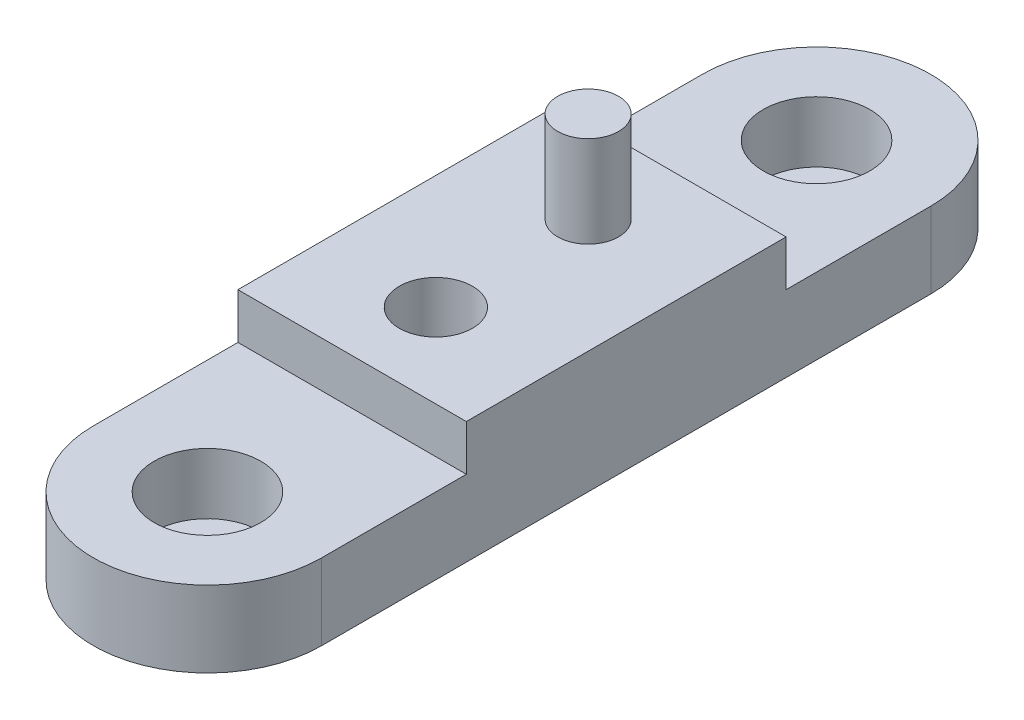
ISO-10303-21;
HEADER;
FILE_DESCRIPTION(('STEP AP214'),'2;1');
FILE_NAME('part.step','',(''),(''),'','','');
FILE_SCHEMA(('AUTOMOTIVE_DESIGN { 1 0 10303 214 1 1 1 1 }'));
ENDSEC;
DATA;
#1=APPLICATION_CONTEXT('core data for automotive mechanical design processes');
#2=APPLICATION_PROTOCOL_DEFINITION('international standard','automotive_design',2000,#1);
#3=PRODUCT_CONTEXT('',#1,'mechanical');
#4=PRODUCT('Part','Part','',(#3));
#5=PRODUCT_RELATED_PRODUCT_CATEGORY('part','',(#4));
#6=PRODUCT_DEFINITION_FORMATION('','',#4);
#7=PRODUCT_DEFINITION_CONTEXT('part definition',#1,'design');
#8=PRODUCT_DEFINITION('design','',#6,#7);
#9=PRODUCT_DEFINITION_SHAPE('','',#8);
#10=(LENGTH_UNIT() NAMED_UNIT(*) SI_UNIT(.MILLI.,.METRE.));
#11=(NAMED_UNIT(*) PLANE_ANGLE_UNIT() SI_UNIT($,.RADIAN.));
#12=(NAMED_UNIT(*) SI_UNIT($,.STERADIAN.) SOLID_ANGLE_UNIT());
#13=UNCERTAINTY_MEASURE_WITH_UNIT(LENGTH_MEASURE(1.E-05),#10,'distance_accuracy_value','');
#14=(GEOMETRIC_REPRESENTATION_CONTEXT(3) GLOBAL_UNCERTAINTY_ASSIGNED_CONTEXT((#13)) GLOBAL_UNIT_ASSIGNED_CONTEXT((#10,
#11,#12)) REPRESENTATION_CONTEXT('',''));
#15=CARTESIAN_POINT('',(0.,0.,0.));
#16=DIRECTION('',(0.,0.,1.));
#17=DIRECTION('',(1.,0.,0.));
#18=AXIS2_PLACEMENT_3D('',#15,#16,#17);
#19=CARTESIAN_POINT('',(0.,4.,0.));
#20=DIRECTION('',(0.,-1.,0.));
#21=DIRECTION('',(0.,0.,-1.));
#22=AXIS2_PLACEMENT_3D('',#19,#20,#21);
#23=CYLINDRICAL_SURFACE('',#22,3.75);
#24=CARTESIAN_POINT('',(0.,2.5,0.));
#25=DIRECTION('',(0.,1.,0.));
#26=DIRECTION('',(0.,0.,1.));
#27=AXIS2_PLACEMENT_3D('',#24,#25,#26);
#28=CIRCLE('',#27,3.75);
#29=CARTESIAN_POINT('',(3.75,2.5,0.));
#30=VERTEX_POINT('',#29);
#31=CARTESIAN_POINT('',(-3.75,2.5,0.));
#32=VERTEX_POINT('',#31);
#33=EDGE_CURVE('E159',#30,#32,#28,.T.);
#34=ORIENTED_EDGE('',*,*,#33,.F.);
#35=DIRECTION('',(0.,-1.,0.));
#36=VECTOR('',#35,1.);
#37=CARTESIAN_POINT('',(3.75,4.,0.));
#38=LINE('',#37,#36);
#39=CARTESIAN_POINT('',(3.75,0.,0.));
#40=VERTEX_POINT('',#39);
#41=EDGE_CURVE('E44',#30,#40,#38,.T.);
#42=ORIENTED_EDGE('',*,*,#41,.T.);
#43=CARTESIAN_POINT('',(0.,0.,0.));
#44=DIRECTION('',(0.,1.,0.));
#45=DIRECTION('',(0.,0.,1.));
#46=AXIS2_PLACEMENT_3D('',#43,#44,#45);
#47=CIRCLE('',#46,3.75);
#48=CARTESIAN_POINT('',(-3.75,0.,0.));
#49=VERTEX_POINT('',#48);
#50=EDGE_CURVE('E165',#40,#49,#47,.T.);
#51=ORIENTED_EDGE('',*,*,#50,.T.);
#52=DIRECTION('',(0.,-1.,0.));
#53=VECTOR('',#52,1.);
#54=CARTESIAN_POINT('',(-3.75,4.,0.));
#55=LINE('',#54,#53);
#56=EDGE_CURVE('E11',#32,#49,#55,.T.);
#57=ORIENTED_EDGE('',*,*,#56,.F.);
#58=EDGE_LOOP('',(#34,#42,#51,#57));
#59=FACE_BOUND('',#58,.T.);
#60=ADVANCED_FACE('F37',(#59),#23,.T.);
#61=CARTESIAN_POINT('',(-3.75,4.,0.));
#62=DIRECTION('',(1.,0.,0.));
#63=DIRECTION('',(0.,0.,-1.));
#64=AXIS2_PLACEMENT_3D('',#61,#62,#63);
#65=PLANE('',#64);
#66=DIRECTION('',(0.,0.,1.));
#67=VECTOR('',#66,1.);
#68=CARTESIAN_POINT('',(-3.75,4.,0.));
#69=LINE('',#68,#67);
#70=CARTESIAN_POINT('',(-3.75,4.,4.75));
#71=VERTEX_POINT('',#70);
#72=CARTESIAN_POINT('',(-3.75,4.,15.25));
#73=VERTEX_POINT('',#72);
#74=EDGE_CURVE('E167',#71,#73,#69,.T.);
#75=ORIENTED_EDGE('',*,*,#74,.F.);
#76=DIRECTION('',(0.,1.,0.));
#77=VECTOR('',#76,1.);
#78=CARTESIAN_POINT('',(-3.75,2.5,4.75));
#79=LINE('',#78,#77);
#80=CARTESIAN_POINT('',(-3.75,2.5,4.75));
#81=VERTEX_POINT('',#80);
#82=EDGE_CURVE('E51',#81,#71,#79,.T.);
#83=ORIENTED_EDGE('',*,*,#82,.F.);
#84=DIRECTION('',(0.,0.,1.));
#85=VECTOR('',#84,1.);
#86=CARTESIAN_POINT('',(-3.75,2.5,0.));
#87=LINE('',#86,#85);
#88=EDGE_CURVE('E151',#32,#81,#87,.T.);
#89=ORIENTED_EDGE('',*,*,#88,.F.);
#90=ORIENTED_EDGE('',*,*,#56,.T.);
#91=DIRECTION('',(0.,0.,1.));
#92=VECTOR('',#91,1.);
#93=CARTESIAN_POINT('',(-3.75,0.,0.));
#94=LINE('',#93,#92);
#95=CARTESIAN_POINT('',(-3.75,0.,20.));
#96=VERTEX_POINT('',#95);
#97=EDGE_CURVE('E174',#49,#96,#94,.T.);
#98=ORIENTED_EDGE('',*,*,#97,.T.);
#99=DIRECTION('',(0.,-1.,0.));
#100=VECTOR('',#99,1.);
#101=CARTESIAN_POINT('',(-3.75,4.,20.));
#102=LINE('',#101,#100);
#103=CARTESIAN_POINT('',(-3.75,2.5,20.));
#104=VERTEX_POINT('',#103);
#105=EDGE_CURVE('E125',#104,#96,#102,.T.);
#106=ORIENTED_EDGE('',*,*,#105,.F.);
#107=DIRECTION('',(0.,0.,-1.));
#108=VECTOR('',#107,1.);
#109=CARTESIAN_POINT('',(-3.75,2.5,20.));
#110=LINE('',#109,#108);
#111=CARTESIAN_POINT('',(-3.75,2.5,15.25));
#112=VERTEX_POINT('',#111);
#113=EDGE_CURVE('E105',#104,#112,#110,.T.);
#114=ORIENTED_EDGE('',*,*,#113,.T.);
#115=DIRECTION('',(0.,1.,0.));
#116=VECTOR('',#115,1.);
#117=CARTESIAN_POINT('',(-3.75,2.5,15.25));
#118=LINE('',#117,#116);
#119=EDGE_CURVE('E114',#112,#73,#118,.T.);
#120=ORIENTED_EDGE('',*,*,#119,.T.);
#121=EDGE_LOOP('',(#75,#83,#89,#90,#98,#106,#114,#120));
#122=FACE_BOUND('',#121,.T.);
#123=ADVANCED_FACE('F123',(#122),#65,.F.);
#124=CARTESIAN_POINT('',(3.75,4.,0.));
#125=DIRECTION('',(-1.,0.,0.));
#126=DIRECTION('',(0.,0.,1.));
#127=AXIS2_PLACEMENT_3D('',#124,#125,#126);
#128=PLANE('',#127);
#129=DIRECTION('',(0.,0.,-1.));
#130=VECTOR('',#129,1.);
#131=CARTESIAN_POINT('',(3.75,2.5,0.));
#132=LINE('',#131,#130);
#133=CARTESIAN_POINT('',(3.75,2.5,4.75));
#134=VERTEX_POINT('',#133);
#135=EDGE_CURVE('E157',#134,#30,#132,.T.);
#136=ORIENTED_EDGE('',*,*,#135,.F.);
#137=DIRECTION('',(0.,1.,0.));
#138=VECTOR('',#137,1.);
#139=CARTESIAN_POINT('',(3.75,2.5,4.75));
#140=LINE('',#139,#138);
#141=CARTESIAN_POINT('',(3.75,4.,4.75));
#142=VERTEX_POINT('',#141);
#143=EDGE_CURVE('E162',#134,#142,#140,.T.);
#144=ORIENTED_EDGE('',*,*,#143,.T.);
#145=DIRECTION('',(0.,0.,-1.));
#146=VECTOR('',#145,1.);
#147=CARTESIAN_POINT('',(3.75,4.,0.));
#148=LINE('',#147,#146);
#149=CARTESIAN_POINT('',(3.75,4.,15.25));
#150=VERTEX_POINT('',#149);
#151=EDGE_CURVE('E169',#150,#142,#148,.T.);
#152=ORIENTED_EDGE('',*,*,#151,.F.);
#153=DIRECTION('',(0.,1.,0.));
#154=VECTOR('',#153,1.);
#155=CARTESIAN_POINT('',(3.75,2.5,15.25));
#156=LINE('',#155,#154);
#157=CARTESIAN_POINT('',(3.75,2.5,15.25));
#158=VERTEX_POINT('',#157);
#159=EDGE_CURVE('E120',#158,#150,#156,.T.);
#160=ORIENTED_EDGE('',*,*,#159,.F.);
#161=DIRECTION('',(0.,0.,1.));
#162=VECTOR('',#161,1.);
#163=CARTESIAN_POINT('',(3.75,2.5,20.));
#164=LINE('',#163,#162);
#165=CARTESIAN_POINT('',(3.75,2.5,20.));
#166=VERTEX_POINT('',#165);
#167=EDGE_CURVE('E107',#158,#166,#164,.T.);
#168=ORIENTED_EDGE('',*,*,#167,.T.);
#169=DIRECTION('',(0.,-1.,0.));
#170=VECTOR('',#169,1.);
#171=CARTESIAN_POINT('',(3.75,4.,20.));
#172=LINE('',#171,#170);
#173=CARTESIAN_POINT('',(3.75,0.,20.));
#174=VERTEX_POINT('',#173);
#175=EDGE_CURVE('E140',#166,#174,#172,.T.);
#176=ORIENTED_EDGE('',*,*,#175,.T.);
#177=DIRECTION('',(0.,0.,-1.));
#178=VECTOR('',#177,1.);
#179=CARTESIAN_POINT('',(3.75,0.,0.));
#180=LINE('',#179,#178);
#181=EDGE_CURVE('E170',#174,#40,#180,.T.);
#182=ORIENTED_EDGE('',*,*,#181,.T.);
#183=ORIENTED_EDGE('',*,*,#41,.F.);
#184=EDGE_LOOP('',(#136,#144,#152,#160,#168,#176,#182,#183));
#185=FACE_BOUND('',#184,.T.);
#186=ADVANCED_FACE('F179',(#185),#128,.F.);
#187=CARTESIAN_POINT('',(0.,4.,0.));
#188=DIRECTION('',(0.,1.,0.));
#189=DIRECTION('',(0.,0.,1.));
#190=AXIS2_PLACEMENT_3D('',#187,#188,#189);
#191=PLANE('',#190);
#192=CARTESIAN_POINT('',(0.,4.,12.5));
#193=DIRECTION('',(0.,1.,0.));
#194=DIRECTION('',(0.,0.,1.));
#195=AXIS2_PLACEMENT_3D('',#192,#193,#194);
#196=CIRCLE('',#195,1.2);
#197=CARTESIAN_POINT('',(0.,4.,13.7));
#198=VERTEX_POINT('',#197);
#199=EDGE_CURVE('E350',#198,#198,#196,.T.);
#200=ORIENTED_EDGE('',*,*,#199,.F.);
#201=EDGE_LOOP('',(#200));
#202=FACE_BOUND('',#201,.T.);
#203=CARTESIAN_POINT('',(0.,4.,7.5));
#204=DIRECTION('',(0.,1.,0.));
#205=DIRECTION('',(0.,0.,1.));
#206=AXIS2_PLACEMENT_3D('',#203,#204,#205);
#207=CIRCLE('',#206,1.);
#208=CARTESIAN_POINT('',(0.,4.,8.5));
#209=VERTEX_POINT('',#208);
#210=EDGE_CURVE('E352',#209,#209,#207,.T.);
#211=ORIENTED_EDGE('',*,*,#210,.F.);
#212=EDGE_LOOP('',(#211));
#213=FACE_BOUND('',#212,.T.);
#214=DIRECTION('',(1.,0.,0.));
#215=VECTOR('',#214,1.);
#216=CARTESIAN_POINT('',(-3.75,4.,4.75));
#217=LINE('',#216,#215);
#218=EDGE_CURVE('E148',#71,#142,#217,.T.);
#219=ORIENTED_EDGE('',*,*,#218,.F.);
#220=ORIENTED_EDGE('',*,*,#74,.T.);
#221=DIRECTION('',(1.,0.,0.));
#222=VECTOR('',#221,1.);
#223=CARTESIAN_POINT('',(-3.75,4.,15.25));
#224=LINE('',#223,#222);
#225=EDGE_CURVE('E117',#73,#150,#224,.T.);
#226=ORIENTED_EDGE('',*,*,#225,.T.);
#227=ORIENTED_EDGE('',*,*,#151,.T.);
#228=EDGE_LOOP('',(#219,#220,#226,#227));
#229=FACE_BOUND('',#228,.T.);
#230=ADVANCED_FACE('F190',(#202,#213,#229),#191,.T.);
#231=CARTESIAN_POINT('',(0.,0.,0.));
#232=DIRECTION('',(0.,1.,0.));
#233=DIRECTION('',(0.,0.,1.));
#234=AXIS2_PLACEMENT_3D('',#231,#232,#233);
#235=PLANE('',#234);
#236=CARTESIAN_POINT('',(0.,0.,12.5));
#237=DIRECTION('',(0.,1.,0.));
#238=DIRECTION('',(0.,0.,1.));
#239=AXIS2_PLACEMENT_3D('',#236,#237,#238);
#240=CIRCLE('',#239,1.2);
#241=CARTESIAN_POINT('',(0.,0.,13.7));
#242=VERTEX_POINT('',#241);
#243=EDGE_CURVE('E347',#242,#242,#240,.T.);
#244=ORIENTED_EDGE('',*,*,#243,.T.);
#245=EDGE_LOOP('',(#244));
#246=FACE_BOUND('',#245,.T.);
#247=ORIENTED_EDGE('',*,*,#50,.F.);
#248=ORIENTED_EDGE('',*,*,#181,.F.);
#249=CARTESIAN_POINT('',(0.,0.,20.));
#250=DIRECTION('',(0.,-1.,0.));
#251=DIRECTION('',(0.,0.,-1.));
#252=AXIS2_PLACEMENT_3D('',#249,#250,#251);
#253=CIRCLE('',#252,3.75);
#254=EDGE_CURVE('E136',#174,#96,#253,.T.);
#255=ORIENTED_EDGE('',*,*,#254,.T.);
#256=ORIENTED_EDGE('',*,*,#97,.F.);
#257=EDGE_LOOP('',(#247,#248,#255,#256));
#258=FACE_BOUND('',#257,.T.);
#259=ADVANCED_FACE('F184',(#246,#258),#235,.F.);
#260=CARTESIAN_POINT('',(-3.75,2.5,4.75));
#261=DIRECTION('',(0.,0.,1.));
#262=DIRECTION('',(1.,0.,0.));
#263=AXIS2_PLACEMENT_3D('',#260,#261,#262);
#264=PLANE('',#263);
#265=ORIENTED_EDGE('',*,*,#218,.T.);
#266=ORIENTED_EDGE('',*,*,#143,.F.);
#267=DIRECTION('',(1.,0.,0.));
#268=VECTOR('',#267,1.);
#269=CARTESIAN_POINT('',(-3.75,2.5,4.75));
#270=LINE('',#269,#268);
#271=EDGE_CURVE('E154',#81,#134,#270,.T.);
#272=ORIENTED_EDGE('',*,*,#271,.F.);
#273=ORIENTED_EDGE('',*,*,#82,.T.);
#274=EDGE_LOOP('',(#265,#266,#272,#273));
#275=FACE_BOUND('',#274,.T.);
#276=ADVANCED_FACE('F215',(#275),#264,.F.);
#277=CARTESIAN_POINT('',(0.,2.5,0.));
#278=DIRECTION('',(0.,1.,0.));
#279=DIRECTION('',(0.,0.,1.));
#280=AXIS2_PLACEMENT_3D('',#277,#278,#279);
#281=PLANE('',#280);
#282=CARTESIAN_POINT('',(0.,2.5,0.));
#283=DIRECTION('',(0.,1.,0.));
#284=DIRECTION('',(0.,0.,1.));
#285=AXIS2_PLACEMENT_3D('',#282,#283,#284);
#286=CIRCLE('',#285,1.75);
#287=CARTESIAN_POINT('',(0.,2.5,1.75));
#288=VERTEX_POINT('',#287);
#289=EDGE_CURVE('E144',#288,#288,#286,.T.);
#290=ORIENTED_EDGE('',*,*,#289,.F.);
#291=EDGE_LOOP('',(#290));
#292=FACE_BOUND('',#291,.T.);
#293=ORIENTED_EDGE('',*,*,#88,.T.);
#294=ORIENTED_EDGE('',*,*,#271,.T.);
#295=ORIENTED_EDGE('',*,*,#135,.T.);
#296=ORIENTED_EDGE('',*,*,#33,.T.);
#297=EDGE_LOOP('',(#293,#294,#295,#296));
#298=FACE_BOUND('',#297,.T.);
#299=ADVANCED_FACE('F188',(#292,#298),#281,.T.);
#300=CARTESIAN_POINT('',(0.,0.5,0.));
#301=DIRECTION('',(0.,1.,0.));
#302=DIRECTION('',(0.,0.,1.));
#303=AXIS2_PLACEMENT_3D('',#300,#301,#302);
#304=CYLINDRICAL_SURFACE('',#303,1.75);
#305=CARTESIAN_POINT('',(0.,0.5,0.));
#306=DIRECTION('',(0.,1.,0.));
#307=DIRECTION('',(0.,0.,1.));
#308=AXIS2_PLACEMENT_3D('',#305,#306,#307);
#309=CIRCLE('',#308,1.75);
#310=CARTESIAN_POINT('',(0.,0.5,1.75));
#311=VERTEX_POINT('',#310);
#312=EDGE_CURVE('E145',#311,#311,#309,.T.);
#313=ORIENTED_EDGE('',*,*,#312,.F.);
#314=EDGE_LOOP('',(#313));
#315=FACE_BOUND('',#314,.T.);
#316=ORIENTED_EDGE('',*,*,#289,.T.);
#317=EDGE_LOOP('',(#316));
#318=FACE_BOUND('',#317,.T.);
#319=ADVANCED_FACE('F201',(#315,#318),#304,.F.);
#320=CARTESIAN_POINT('',(0.,0.5,0.));
#321=DIRECTION('',(0.,1.,0.));
#322=DIRECTION('',(0.,0.,1.));
#323=AXIS2_PLACEMENT_3D('',#320,#321,#322);
#324=PLANE('',#323);
#325=ORIENTED_EDGE('',*,*,#312,.T.);
#326=EDGE_LOOP('',(#325));
#327=FACE_BOUND('',#326,.T.);
#328=ADVANCED_FACE('F194',(#327),#324,.T.);
#329=CARTESIAN_POINT('',(0.,4.,20.));
#330=DIRECTION('',(0.,-1.,0.));
#331=DIRECTION('',(0.,0.,1.));
#332=AXIS2_PLACEMENT_3D('',#329,#330,#331);
#333=CYLINDRICAL_SURFACE('',#332,3.75);
#334=CARTESIAN_POINT('',(0.,2.5,20.));
#335=DIRECTION('',(0.,-1.,0.));
#336=DIRECTION('',(0.,0.,-1.));
#337=AXIS2_PLACEMENT_3D('',#334,#335,#336);
#338=CIRCLE('',#337,3.75);
#339=EDGE_CURVE('E121',#166,#104,#338,.T.);
#340=ORIENTED_EDGE('',*,*,#339,.T.);
#341=ORIENTED_EDGE('',*,*,#105,.T.);
#342=ORIENTED_EDGE('',*,*,#254,.F.);
#343=ORIENTED_EDGE('',*,*,#175,.F.);
#344=EDGE_LOOP('',(#340,#341,#342,#343));
#345=FACE_BOUND('',#344,.T.);
#346=ADVANCED_FACE('F192',(#345),#333,.T.);
#347=CARTESIAN_POINT('',(-3.75,2.5,15.25));
#348=DIRECTION('',(0.,0.,-1.));
#349=DIRECTION('',(1.,0.,0.));
#350=AXIS2_PLACEMENT_3D('',#347,#348,#349);
#351=PLANE('',#350);
#352=ORIENTED_EDGE('',*,*,#225,.F.);
#353=ORIENTED_EDGE('',*,*,#119,.F.);
#354=DIRECTION('',(1.,0.,0.));
#355=VECTOR('',#354,1.);
#356=CARTESIAN_POINT('',(-3.75,2.5,15.25));
#357=LINE('',#356,#355);
#358=EDGE_CURVE('E100',#112,#158,#357,.T.);
#359=ORIENTED_EDGE('',*,*,#358,.T.);
#360=ORIENTED_EDGE('',*,*,#159,.T.);
#361=EDGE_LOOP('',(#352,#353,#359,#360));
#362=FACE_BOUND('',#361,.T.);
#363=ADVANCED_FACE('F115',(#362),#351,.F.);
#364=CARTESIAN_POINT('',(0.,2.5,20.));
#365=DIRECTION('',(0.,1.,0.));
#366=DIRECTION('',(0.,0.,-1.));
#367=AXIS2_PLACEMENT_3D('',#364,#365,#366);
#368=PLANE('',#367);
#369=CARTESIAN_POINT('',(0.,2.5,20.));
#370=DIRECTION('',(0.,-1.,0.));
#371=DIRECTION('',(0.,0.,-1.));
#372=AXIS2_PLACEMENT_3D('',#369,#370,#371);
#373=CIRCLE('',#372,1.75);
#374=CARTESIAN_POINT('',(0.,2.5,18.25));
#375=VERTEX_POINT('',#374);
#376=EDGE_CURVE('E131',#375,#375,#373,.T.);
#377=ORIENTED_EDGE('',*,*,#376,.T.);
#378=EDGE_LOOP('',(#377));
#379=FACE_BOUND('',#378,.T.);
#380=ORIENTED_EDGE('',*,*,#113,.F.);
#381=ORIENTED_EDGE('',*,*,#339,.F.);
#382=ORIENTED_EDGE('',*,*,#167,.F.);
#383=ORIENTED_EDGE('',*,*,#358,.F.);
#384=EDGE_LOOP('',(#380,#381,#382,#383));
#385=FACE_BOUND('',#384,.T.);
#386=ADVANCED_FACE('F102',(#379,#385),#368,.T.);
#387=CARTESIAN_POINT('',(0.,0.5,20.));
#388=DIRECTION('',(0.,1.,0.));
#389=DIRECTION('',(0.,0.,-1.));
#390=AXIS2_PLACEMENT_3D('',#387,#388,#389);
#391=CYLINDRICAL_SURFACE('',#390,1.75);
#392=CARTESIAN_POINT('',(0.,0.5,20.));
#393=DIRECTION('',(0.,-1.,0.));
#394=DIRECTION('',(0.,0.,-1.));
#395=AXIS2_PLACEMENT_3D('',#392,#393,#394);
#396=CIRCLE('',#395,1.75);
#397=CARTESIAN_POINT('',(0.,0.5,18.25));
#398=VERTEX_POINT('',#397);
#399=EDGE_CURVE('E128',#398,#398,#396,.T.);
#400=ORIENTED_EDGE('',*,*,#399,.T.);
#401=EDGE_LOOP('',(#400));
#402=FACE_BOUND('',#401,.T.);
#403=ORIENTED_EDGE('',*,*,#376,.F.);
#404=EDGE_LOOP('',(#403));
#405=FACE_BOUND('',#404,.T.);
#406=ADVANCED_FACE('F292',(#402,#405),#391,.F.);
#407=CARTESIAN_POINT('',(0.,0.5,20.));
#408=DIRECTION('',(0.,1.,0.));
#409=DIRECTION('',(0.,0.,-1.));
#410=AXIS2_PLACEMENT_3D('',#407,#408,#409);
#411=PLANE('',#410);
#412=ORIENTED_EDGE('',*,*,#399,.F.);
#413=EDGE_LOOP('',(#412));
#414=FACE_BOUND('',#413,.T.);
#415=ADVANCED_FACE('F301',(#414),#411,.T.);
#416=CARTESIAN_POINT('',(0.,7.,7.5));
#417=DIRECTION('',(0.,-1.,0.));
#418=DIRECTION('',(0.,0.,-1.));
#419=AXIS2_PLACEMENT_3D('',#416,#417,#418);
#420=CYLINDRICAL_SURFACE('',#419,1.);
#421=CARTESIAN_POINT('',(0.,7.,7.5));
#422=DIRECTION('',(0.,1.,0.));
#423=DIRECTION('',(0.,0.,1.));
#424=AXIS2_PLACEMENT_3D('',#421,#422,#423);
#425=CIRCLE('',#424,1.);
#426=CARTESIAN_POINT('',(0.,7.,8.5));
#427=VERTEX_POINT('',#426);
#428=EDGE_CURVE('E355',#427,#427,#425,.T.);
#429=ORIENTED_EDGE('',*,*,#428,.F.);
#430=EDGE_LOOP('',(#429));
#431=FACE_BOUND('',#430,.T.);
#432=ORIENTED_EDGE('',*,*,#210,.T.);
#433=EDGE_LOOP('',(#432));
#434=FACE_BOUND('',#433,.T.);
#435=ADVANCED_FACE('F310',(#431,#434),#420,.T.);
#436=CARTESIAN_POINT('',(0.,7.,7.5));
#437=DIRECTION('',(0.,1.,0.));
#438=DIRECTION('',(0.,0.,1.));
#439=AXIS2_PLACEMENT_3D('',#436,#437,#438);
#440=PLANE('',#439);
#441=ORIENTED_EDGE('',*,*,#428,.T.);
#442=EDGE_LOOP('',(#441));
#443=FACE_BOUND('',#442,.T.);
#444=ADVANCED_FACE('F319',(#443),#440,.T.);
#445=CARTESIAN_POINT('',(0.,0.,12.5));
#446=DIRECTION('',(0.,1.,0.));
#447=DIRECTION('',(0.,0.,1.));
#448=AXIS2_PLACEMENT_3D('',#445,#446,#447);
#449=CYLINDRICAL_SURFACE('',#448,1.2);
#450=ORIENTED_EDGE('',*,*,#243,.F.);
#451=EDGE_LOOP('',(#450));
#452=FACE_BOUND('',#451,.T.);
#453=ORIENTED_EDGE('',*,*,#199,.T.);
#454=EDGE_LOOP('',(#453));
#455=FACE_BOUND('',#454,.T.);
#456=ADVANCED_FACE('F327',(#452,#455),#449,.F.);
#457=CLOSED_SHELL('',(#60,#123,#186,#230,#259,#276,#299,#319,#328,#346,#363,#386,#406,#415,#435,
#444,#456));
#458=MANIFOLD_SOLID_BREP('B2',#457);
#459=ADVANCED_BREP_SHAPE_REPRESENTATION('',(#18,#458),#14);
#460=SHAPE_DEFINITION_REPRESENTATION(#9,#459);
ENDSEC;
END-ISO-10303-21;
